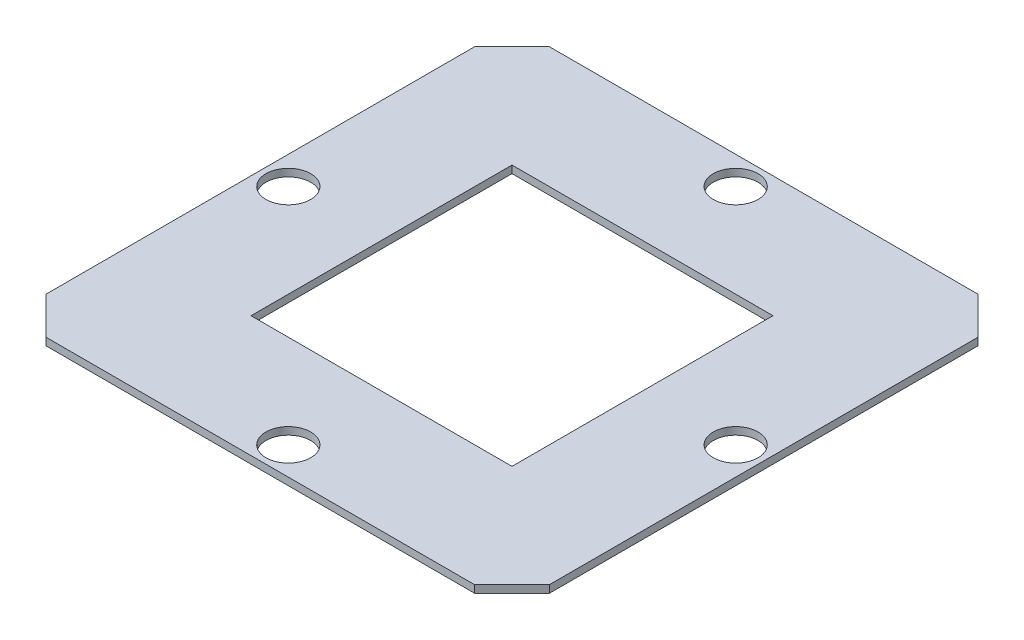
ISO-10303-21;
HEADER;
FILE_DESCRIPTION(('STEP AP214'),'2;1');
FILE_NAME('part.step','',(''),(''),'','','');
FILE_SCHEMA(('AUTOMOTIVE_DESIGN { 1 0 10303 214 1 1 1 1 }'));
ENDSEC;
DATA;
#1=APPLICATION_CONTEXT('core data for automotive mechanical design processes');
#2=APPLICATION_PROTOCOL_DEFINITION('international standard','automotive_design',2000,#1);
#3=PRODUCT_CONTEXT('',#1,'mechanical');
#4=PRODUCT('Part','Part','',(#3));
#5=PRODUCT_RELATED_PRODUCT_CATEGORY('part','',(#4));
#6=PRODUCT_DEFINITION_FORMATION('','',#4);
#7=PRODUCT_DEFINITION_CONTEXT('part definition',#1,'design');
#8=PRODUCT_DEFINITION('design','',#6,#7);
#9=PRODUCT_DEFINITION_SHAPE('','',#8);
#10=(LENGTH_UNIT() NAMED_UNIT(*) SI_UNIT(.MILLI.,.METRE.));
#11=(NAMED_UNIT(*) PLANE_ANGLE_UNIT() SI_UNIT($,.RADIAN.));
#12=(NAMED_UNIT(*) SI_UNIT($,.STERADIAN.) SOLID_ANGLE_UNIT());
#13=UNCERTAINTY_MEASURE_WITH_UNIT(LENGTH_MEASURE(1.E-05),#10,'distance_accuracy_value','');
#14=(GEOMETRIC_REPRESENTATION_CONTEXT(3) GLOBAL_UNCERTAINTY_ASSIGNED_CONTEXT((#13)) GLOBAL_UNIT_ASSIGNED_CONTEXT((#10,
#11,#12)) REPRESENTATION_CONTEXT('',''));
#15=CARTESIAN_POINT('',(0.,0.,0.));
#16=DIRECTION('',(0.,0.,1.));
#17=DIRECTION('',(1.,0.,0.));
#18=AXIS2_PLACEMENT_3D('',#15,#16,#17);
#19=CARTESIAN_POINT('',(-67.5,2.,-67.5));
#20=DIRECTION('',(0.,0.,1.));
#21=DIRECTION('',(1.,0.,0.));
#22=AXIS2_PLACEMENT_3D('',#19,#20,#21);
#23=PLANE('',#22);
#24=DIRECTION('',(-1.,0.,0.));
#25=VECTOR('',#24,1.);
#26=CARTESIAN_POINT('',(-67.5,0.,-67.5));
#27=LINE('',#26,#25);
#28=CARTESIAN_POINT('',(57.5,0.,-67.5));
#29=VERTEX_POINT('',#28);
#30=CARTESIAN_POINT('',(-57.5,0.,-67.5));
#31=VERTEX_POINT('',#30);
#32=EDGE_CURVE('E176',#29,#31,#27,.T.);
#33=ORIENTED_EDGE('',*,*,#32,.T.);
#34=DIRECTION('',(0.,1.,0.));
#35=VECTOR('',#34,1.);
#36=CARTESIAN_POINT('',(-57.5,2.,-67.5));
#37=LINE('',#36,#35);
#38=CARTESIAN_POINT('',(-57.5,2.,-67.5));
#39=VERTEX_POINT('',#38);
#40=EDGE_CURVE('E218',#31,#39,#37,.T.);
#41=ORIENTED_EDGE('',*,*,#40,.T.);
#42=DIRECTION('',(-1.,0.,0.));
#43=VECTOR('',#42,1.);
#44=CARTESIAN_POINT('',(-67.5,2.,-67.5));
#45=LINE('',#44,#43);
#46=CARTESIAN_POINT('',(57.5,2.,-67.5));
#47=VERTEX_POINT('',#46);
#48=EDGE_CURVE('E179',#47,#39,#45,.T.);
#49=ORIENTED_EDGE('',*,*,#48,.F.);
#50=DIRECTION('',(0.,-1.,0.));
#51=VECTOR('',#50,1.);
#52=CARTESIAN_POINT('',(57.5,2.,-67.5));
#53=LINE('',#52,#51);
#54=EDGE_CURVE('E215',#47,#29,#53,.T.);
#55=ORIENTED_EDGE('',*,*,#54,.T.);
#56=EDGE_LOOP('',(#33,#41,#49,#55));
#57=FACE_BOUND('',#56,.T.);
#58=ADVANCED_FACE('F32',(#57),#23,.F.);
#59=CARTESIAN_POINT('',(-67.5,2.,67.5));
#60=DIRECTION('',(1.,0.,0.));
#61=DIRECTION('',(0.,0.,-1.));
#62=AXIS2_PLACEMENT_3D('',#59,#60,#61);
#63=PLANE('',#62);
#64=DIRECTION('',(0.,0.,1.));
#65=VECTOR('',#64,1.);
#66=CARTESIAN_POINT('',(-67.5,2.,67.5));
#67=LINE('',#66,#65);
#68=CARTESIAN_POINT('',(-67.5,2.,-57.5));
#69=VERTEX_POINT('',#68);
#70=CARTESIAN_POINT('',(-67.5,2.,57.5));
#71=VERTEX_POINT('',#70);
#72=EDGE_CURVE('E182',#69,#71,#67,.T.);
#73=ORIENTED_EDGE('',*,*,#72,.F.);
#74=DIRECTION('',(0.,-1.,0.));
#75=VECTOR('',#74,1.);
#76=CARTESIAN_POINT('',(-67.5,2.,-57.5));
#77=LINE('',#76,#75);
#78=CARTESIAN_POINT('',(-67.5,0.,-57.5));
#79=VERTEX_POINT('',#78);
#80=EDGE_CURVE('E204',#69,#79,#77,.T.);
#81=ORIENTED_EDGE('',*,*,#80,.T.);
#82=DIRECTION('',(0.,0.,1.));
#83=VECTOR('',#82,1.);
#84=CARTESIAN_POINT('',(-67.5,0.,67.5));
#85=LINE('',#84,#83);
#86=CARTESIAN_POINT('',(-67.5,0.,57.5));
#87=VERTEX_POINT('',#86);
#88=EDGE_CURVE('E195',#79,#87,#85,.T.);
#89=ORIENTED_EDGE('',*,*,#88,.T.);
#90=DIRECTION('',(0.,1.,0.));
#91=VECTOR('',#90,1.);
#92=CARTESIAN_POINT('',(-67.5,2.,57.5));
#93=LINE('',#92,#91);
#94=EDGE_CURVE('E192',#87,#71,#93,.T.);
#95=ORIENTED_EDGE('',*,*,#94,.T.);
#96=EDGE_LOOP('',(#73,#81,#89,#95));
#97=FACE_BOUND('',#96,.T.);
#98=ADVANCED_FACE('F268',(#97),#63,.F.);
#99=CARTESIAN_POINT('',(-67.5,2.,67.5));
#100=DIRECTION('',(0.,0.,-1.));
#101=DIRECTION('',(-1.,0.,0.));
#102=AXIS2_PLACEMENT_3D('',#99,#100,#101);
#103=PLANE('',#102);
#104=DIRECTION('',(1.,0.,0.));
#105=VECTOR('',#104,1.);
#106=CARTESIAN_POINT('',(-67.5,0.,67.5));
#107=LINE('',#106,#105);
#108=CARTESIAN_POINT('',(-57.5,0.,67.5));
#109=VERTEX_POINT('',#108);
#110=CARTESIAN_POINT('',(57.5,0.,67.5));
#111=VERTEX_POINT('',#110);
#112=EDGE_CURVE('E198',#109,#111,#107,.T.);
#113=ORIENTED_EDGE('',*,*,#112,.T.);
#114=DIRECTION('',(0.,1.,0.));
#115=VECTOR('',#114,1.);
#116=CARTESIAN_POINT('',(57.5,2.,67.5));
#117=LINE('',#116,#115);
#118=CARTESIAN_POINT('',(57.4999999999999,2.,67.5));
#119=VERTEX_POINT('',#118);
#120=EDGE_CURVE('E11',#111,#119,#117,.T.);
#121=ORIENTED_EDGE('',*,*,#120,.T.);
#122=DIRECTION('',(1.,0.,0.));
#123=VECTOR('',#122,1.);
#124=CARTESIAN_POINT('',(-67.5,2.,67.5));
#125=LINE('',#124,#123);
#126=CARTESIAN_POINT('',(-57.5,2.,67.5));
#127=VERTEX_POINT('',#126);
#128=EDGE_CURVE('E186',#127,#119,#125,.T.);
#129=ORIENTED_EDGE('',*,*,#128,.F.);
#130=DIRECTION('',(0.,-1.,0.));
#131=VECTOR('',#130,1.);
#132=CARTESIAN_POINT('',(-57.5,2.,67.5));
#133=LINE('',#132,#131);
#134=EDGE_CURVE('E40',#127,#109,#133,.T.);
#135=ORIENTED_EDGE('',*,*,#134,.T.);
#136=EDGE_LOOP('',(#113,#121,#129,#135));
#137=FACE_BOUND('',#136,.T.);
#138=ADVANCED_FACE('F237',(#137),#103,.F.);
#139=CARTESIAN_POINT('',(67.5,2.,67.5));
#140=DIRECTION('',(-1.,0.,0.));
#141=DIRECTION('',(0.,0.,1.));
#142=AXIS2_PLACEMENT_3D('',#139,#140,#141);
#143=PLANE('',#142);
#144=DIRECTION('',(0.,0.,-1.));
#145=VECTOR('',#144,1.);
#146=CARTESIAN_POINT('',(67.5,0.,67.5));
#147=LINE('',#146,#145);
#148=CARTESIAN_POINT('',(67.5,0.,57.5));
#149=VERTEX_POINT('',#148);
#150=CARTESIAN_POINT('',(67.5,0.,-57.5));
#151=VERTEX_POINT('',#150);
#152=EDGE_CURVE('E183',#149,#151,#147,.T.);
#153=ORIENTED_EDGE('',*,*,#152,.T.);
#154=DIRECTION('',(0.,1.,0.));
#155=VECTOR('',#154,1.);
#156=CARTESIAN_POINT('',(67.5,2.,-57.5));
#157=LINE('',#156,#155);
#158=CARTESIAN_POINT('',(67.5,2.,-57.4999999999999));
#159=VERTEX_POINT('',#158);
#160=EDGE_CURVE('E231',#151,#159,#157,.T.);
#161=ORIENTED_EDGE('',*,*,#160,.T.);
#162=DIRECTION('',(0.,0.,-1.));
#163=VECTOR('',#162,1.);
#164=CARTESIAN_POINT('',(67.5,2.,67.5));
#165=LINE('',#164,#163);
#166=CARTESIAN_POINT('',(67.5,2.,57.5));
#167=VERTEX_POINT('',#166);
#168=EDGE_CURVE('E189',#167,#159,#165,.T.);
#169=ORIENTED_EDGE('',*,*,#168,.F.);
#170=DIRECTION('',(0.,-1.,0.));
#171=VECTOR('',#170,1.);
#172=CARTESIAN_POINT('',(67.5,2.,57.5));
#173=LINE('',#172,#171);
#174=EDGE_CURVE('E228',#167,#149,#173,.T.);
#175=ORIENTED_EDGE('',*,*,#174,.T.);
#176=EDGE_LOOP('',(#153,#161,#169,#175));
#177=FACE_BOUND('',#176,.T.);
#178=ADVANCED_FACE('F251',(#177),#143,.F.);
#179=CARTESIAN_POINT('',(67.5,2.,-67.5));
#180=DIRECTION('',(0.,1.,0.));
#181=DIRECTION('',(0.,0.,1.));
#182=AXIS2_PLACEMENT_3D('',#179,#180,#181);
#183=PLANE('',#182);
#184=DIRECTION('',(-1.,0.,0.));
#185=VECTOR('',#184,1.);
#186=CARTESIAN_POINT('',(-35.,2.,35.));
#187=LINE('',#186,#185);
#188=CARTESIAN_POINT('',(35.,2.,35.));
#189=VERTEX_POINT('',#188);
#190=CARTESIAN_POINT('',(-35.,2.,35.));
#191=VERTEX_POINT('',#190);
#192=EDGE_CURVE('E130',#189,#191,#187,.T.);
#193=ORIENTED_EDGE('',*,*,#192,.T.);
#194=DIRECTION('',(0.,0.,-1.));
#195=VECTOR('',#194,1.);
#196=CARTESIAN_POINT('',(-35.,2.,-35.));
#197=LINE('',#196,#195);
#198=CARTESIAN_POINT('',(-35.,2.,-35.));
#199=VERTEX_POINT('',#198);
#200=EDGE_CURVE('E119',#191,#199,#197,.T.);
#201=ORIENTED_EDGE('',*,*,#200,.T.);
#202=DIRECTION('',(1.,0.,0.));
#203=VECTOR('',#202,1.);
#204=CARTESIAN_POINT('',(-35.,2.,-35.));
#205=LINE('',#204,#203);
#206=CARTESIAN_POINT('',(35.,2.,-35.));
#207=VERTEX_POINT('',#206);
#208=EDGE_CURVE('E141',#199,#207,#205,.T.);
#209=ORIENTED_EDGE('',*,*,#208,.T.);
#210=DIRECTION('',(0.,0.,1.));
#211=VECTOR('',#210,1.);
#212=CARTESIAN_POINT('',(35.,2.,-35.));
#213=LINE('',#212,#211);
#214=EDGE_CURVE('E137',#207,#189,#213,.T.);
#215=ORIENTED_EDGE('',*,*,#214,.T.);
#216=EDGE_LOOP('',(#193,#201,#209,#215));
#217=FACE_BOUND('',#216,.T.);
#218=CARTESIAN_POINT('',(-59.9999999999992,2.,0.));
#219=DIRECTION('',(0.,1.,0.));
#220=DIRECTION('',(0.,0.,1.));
#221=AXIS2_PLACEMENT_3D('',#218,#219,#220);
#222=CIRCLE('',#221,6.);
#223=CARTESIAN_POINT('',(-59.9999999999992,2.,6.));
#224=VERTEX_POINT('',#223);
#225=EDGE_CURVE('E126',#224,#224,#222,.T.);
#226=ORIENTED_EDGE('',*,*,#225,.F.);
#227=EDGE_LOOP('',(#226));
#228=FACE_BOUND('',#227,.T.);
#229=CARTESIAN_POINT('',(7.84422772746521E-13,2.,60.));
#230=DIRECTION('',(0.,1.,0.));
#231=DIRECTION('',(0.,0.,1.));
#232=AXIS2_PLACEMENT_3D('',#229,#230,#231);
#233=CIRCLE('',#232,6.);
#234=CARTESIAN_POINT('',(7.84422772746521E-13,2.,66.));
#235=VERTEX_POINT('',#234);
#236=EDGE_CURVE('E158',#235,#235,#233,.T.);
#237=ORIENTED_EDGE('',*,*,#236,.F.);
#238=EDGE_LOOP('',(#237));
#239=FACE_BOUND('',#238,.T.);
#240=CARTESIAN_POINT('',(60.,2.,0.));
#241=DIRECTION('',(0.,1.,0.));
#242=DIRECTION('',(0.,0.,1.));
#243=AXIS2_PLACEMENT_3D('',#240,#241,#242);
#244=CIRCLE('',#243,6.);
#245=CARTESIAN_POINT('',(60.,2.,6.));
#246=VERTEX_POINT('',#245);
#247=EDGE_CURVE('E164',#246,#246,#244,.T.);
#248=ORIENTED_EDGE('',*,*,#247,.F.);
#249=EDGE_LOOP('',(#248));
#250=FACE_BOUND('',#249,.T.);
#251=CARTESIAN_POINT('',(7.69685902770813E-13,2.,-60.));
#252=DIRECTION('',(0.,1.,0.));
#253=DIRECTION('',(0.,0.,1.));
#254=AXIS2_PLACEMENT_3D('',#251,#252,#253);
#255=CIRCLE('',#254,6.);
#256=CARTESIAN_POINT('',(7.69685902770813E-13,2.,-54.));
#257=VERTEX_POINT('',#256);
#258=EDGE_CURVE('E170',#257,#257,#255,.T.);
#259=ORIENTED_EDGE('',*,*,#258,.F.);
#260=EDGE_LOOP('',(#259));
#261=FACE_BOUND('',#260,.T.);
#262=ORIENTED_EDGE('',*,*,#48,.T.);
#263=DIRECTION('',(0.707106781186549,0.,-0.707106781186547));
#264=VECTOR('',#263,1.);
#265=CARTESIAN_POINT('',(5.00000000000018,2.,-130.));
#266=LINE('',#265,#264);
#267=EDGE_CURVE('E226',#39,#69,#266,.F.);
#268=ORIENTED_EDGE('',*,*,#267,.T.);
#269=ORIENTED_EDGE('',*,*,#72,.T.);
#270=DIRECTION('',(-0.707106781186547,0.,-0.707106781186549));
#271=VECTOR('',#270,1.);
#272=CARTESIAN_POINT('',(-62.5000000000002,2.,62.4999999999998));
#273=LINE('',#272,#271);
#274=EDGE_CURVE('E220',#71,#127,#273,.F.);
#275=ORIENTED_EDGE('',*,*,#274,.T.);
#276=ORIENTED_EDGE('',*,*,#128,.T.);
#277=DIRECTION('',(-0.707106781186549,0.,0.707106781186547));
#278=VECTOR('',#277,1.);
#279=CARTESIAN_POINT('',(130.,2.,-4.99999999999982));
#280=LINE('',#279,#278);
#281=EDGE_CURVE('E222',#119,#167,#280,.F.);
#282=ORIENTED_EDGE('',*,*,#281,.T.);
#283=ORIENTED_EDGE('',*,*,#168,.T.);
#284=DIRECTION('',(0.707106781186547,0.,0.707106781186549));
#285=VECTOR('',#284,1.);
#286=CARTESIAN_POINT('',(62.5,2.,-62.5));
#287=LINE('',#286,#285);
#288=EDGE_CURVE('E224',#159,#47,#287,.F.);
#289=ORIENTED_EDGE('',*,*,#288,.T.);
#290=EDGE_LOOP('',(#262,#268,#269,#275,#276,#282,#283,#289));
#291=FACE_BOUND('',#290,.T.);
#292=ADVANCED_FACE('F135',(#217,#228,#239,#250,#261,#291),#183,.T.);
#293=CARTESIAN_POINT('',(67.5,0.,-67.5));
#294=DIRECTION('',(0.,1.,0.));
#295=DIRECTION('',(0.,0.,1.));
#296=AXIS2_PLACEMENT_3D('',#293,#294,#295);
#297=PLANE('',#296);
#298=DIRECTION('',(0.,0.,-1.));
#299=VECTOR('',#298,1.);
#300=CARTESIAN_POINT('',(-35.,0.,-35.));
#301=LINE('',#300,#299);
#302=CARTESIAN_POINT('',(-35.,0.,35.));
#303=VERTEX_POINT('',#302);
#304=CARTESIAN_POINT('',(-35.,0.,-35.));
#305=VERTEX_POINT('',#304);
#306=EDGE_CURVE('E139',#303,#305,#301,.T.);
#307=ORIENTED_EDGE('',*,*,#306,.F.);
#308=DIRECTION('',(-1.,0.,0.));
#309=VECTOR('',#308,1.);
#310=CARTESIAN_POINT('',(-35.,0.,35.));
#311=LINE('',#310,#309);
#312=CARTESIAN_POINT('',(35.,0.,35.));
#313=VERTEX_POINT('',#312);
#314=EDGE_CURVE('E55',#313,#303,#311,.T.);
#315=ORIENTED_EDGE('',*,*,#314,.F.);
#316=DIRECTION('',(0.,0.,1.));
#317=VECTOR('',#316,1.);
#318=CARTESIAN_POINT('',(35.,0.,-35.));
#319=LINE('',#318,#317);
#320=CARTESIAN_POINT('',(35.,0.,-35.));
#321=VERTEX_POINT('',#320);
#322=EDGE_CURVE('E132',#321,#313,#319,.T.);
#323=ORIENTED_EDGE('',*,*,#322,.F.);
#324=DIRECTION('',(1.,0.,0.));
#325=VECTOR('',#324,1.);
#326=CARTESIAN_POINT('',(-35.,0.,-35.));
#327=LINE('',#326,#325);
#328=EDGE_CURVE('E146',#305,#321,#327,.T.);
#329=ORIENTED_EDGE('',*,*,#328,.F.);
#330=EDGE_LOOP('',(#307,#315,#323,#329));
#331=FACE_BOUND('',#330,.T.);
#332=CARTESIAN_POINT('',(-59.9999999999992,0.,0.));
#333=DIRECTION('',(0.,1.,0.));
#334=DIRECTION('',(0.,0.,1.));
#335=AXIS2_PLACEMENT_3D('',#332,#333,#334);
#336=CIRCLE('',#335,6.);
#337=CARTESIAN_POINT('',(-59.9999999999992,0.,6.));
#338=VERTEX_POINT('',#337);
#339=EDGE_CURVE('E155',#338,#338,#336,.T.);
#340=ORIENTED_EDGE('',*,*,#339,.T.);
#341=EDGE_LOOP('',(#340));
#342=FACE_BOUND('',#341,.T.);
#343=CARTESIAN_POINT('',(7.84422772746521E-13,0.,60.));
#344=DIRECTION('',(0.,1.,0.));
#345=DIRECTION('',(0.,0.,1.));
#346=AXIS2_PLACEMENT_3D('',#343,#344,#345);
#347=CIRCLE('',#346,6.);
#348=CARTESIAN_POINT('',(7.84422772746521E-13,0.,66.));
#349=VERTEX_POINT('',#348);
#350=EDGE_CURVE('E161',#349,#349,#347,.T.);
#351=ORIENTED_EDGE('',*,*,#350,.T.);
#352=EDGE_LOOP('',(#351));
#353=FACE_BOUND('',#352,.T.);
#354=CARTESIAN_POINT('',(60.,0.,0.));
#355=DIRECTION('',(0.,1.,0.));
#356=DIRECTION('',(0.,0.,1.));
#357=AXIS2_PLACEMENT_3D('',#354,#355,#356);
#358=CIRCLE('',#357,6.);
#359=CARTESIAN_POINT('',(60.,0.,6.));
#360=VERTEX_POINT('',#359);
#361=EDGE_CURVE('E167',#360,#360,#358,.T.);
#362=ORIENTED_EDGE('',*,*,#361,.T.);
#363=EDGE_LOOP('',(#362));
#364=FACE_BOUND('',#363,.T.);
#365=CARTESIAN_POINT('',(7.69685902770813E-13,0.,-60.));
#366=DIRECTION('',(0.,1.,0.));
#367=DIRECTION('',(0.,0.,1.));
#368=AXIS2_PLACEMENT_3D('',#365,#366,#367);
#369=CIRCLE('',#368,6.);
#370=CARTESIAN_POINT('',(7.69685902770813E-13,0.,-54.));
#371=VERTEX_POINT('',#370);
#372=EDGE_CURVE('E173',#371,#371,#369,.T.);
#373=ORIENTED_EDGE('',*,*,#372,.T.);
#374=EDGE_LOOP('',(#373));
#375=FACE_BOUND('',#374,.T.);
#376=ORIENTED_EDGE('',*,*,#88,.F.);
#377=DIRECTION('',(-0.707106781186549,0.,0.707106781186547));
#378=VECTOR('',#377,1.);
#379=CARTESIAN_POINT('',(-67.5,0.,-57.5));
#380=LINE('',#379,#378);
#381=EDGE_CURVE('E213',#79,#31,#380,.F.);
#382=ORIENTED_EDGE('',*,*,#381,.T.);
#383=ORIENTED_EDGE('',*,*,#32,.F.);
#384=DIRECTION('',(-0.707106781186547,0.,-0.707106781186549));
#385=VECTOR('',#384,1.);
#386=CARTESIAN_POINT('',(57.5,0.,-67.5));
#387=LINE('',#386,#385);
#388=EDGE_CURVE('E211',#29,#151,#387,.F.);
#389=ORIENTED_EDGE('',*,*,#388,.T.);
#390=ORIENTED_EDGE('',*,*,#152,.F.);
#391=DIRECTION('',(0.707106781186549,0.,-0.707106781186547));
#392=VECTOR('',#391,1.);
#393=CARTESIAN_POINT('',(67.5,0.,57.5));
#394=LINE('',#393,#392);
#395=EDGE_CURVE('E209',#149,#111,#394,.F.);
#396=ORIENTED_EDGE('',*,*,#395,.T.);
#397=ORIENTED_EDGE('',*,*,#112,.F.);
#398=DIRECTION('',(0.707106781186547,0.,0.707106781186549));
#399=VECTOR('',#398,1.);
#400=CARTESIAN_POINT('',(-57.5,0.,67.5));
#401=LINE('',#400,#399);
#402=EDGE_CURVE('E207',#109,#87,#401,.F.);
#403=ORIENTED_EDGE('',*,*,#402,.T.);
#404=EDGE_LOOP('',(#376,#382,#383,#389,#390,#396,#397,#403));
#405=FACE_BOUND('',#404,.T.);
#406=ADVANCED_FACE('F243',(#331,#342,#353,#364,#375,#405),#297,.F.);
#407=CARTESIAN_POINT('',(7.69685902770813E-13,0.,-60.));
#408=DIRECTION('',(0.,1.,0.));
#409=DIRECTION('',(0.,0.,1.));
#410=AXIS2_PLACEMENT_3D('',#407,#408,#409);
#411=CYLINDRICAL_SURFACE('',#410,6.);
#412=ORIENTED_EDGE('',*,*,#372,.F.);
#413=EDGE_LOOP('',(#412));
#414=FACE_BOUND('',#413,.T.);
#415=ORIENTED_EDGE('',*,*,#258,.T.);
#416=EDGE_LOOP('',(#415));
#417=FACE_BOUND('',#416,.T.);
#418=ADVANCED_FACE('F322',(#414,#417),#411,.F.);
#419=CARTESIAN_POINT('',(60.,0.,0.));
#420=DIRECTION('',(0.,1.,0.));
#421=DIRECTION('',(0.,0.,1.));
#422=AXIS2_PLACEMENT_3D('',#419,#420,#421);
#423=CYLINDRICAL_SURFACE('',#422,6.);
#424=ORIENTED_EDGE('',*,*,#361,.F.);
#425=EDGE_LOOP('',(#424));
#426=FACE_BOUND('',#425,.T.);
#427=ORIENTED_EDGE('',*,*,#247,.T.);
#428=EDGE_LOOP('',(#427));
#429=FACE_BOUND('',#428,.T.);
#430=ADVANCED_FACE('F367',(#426,#429),#423,.F.);
#431=CARTESIAN_POINT('',(7.84422772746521E-13,0.,60.));
#432=DIRECTION('',(0.,1.,0.));
#433=DIRECTION('',(0.,0.,1.));
#434=AXIS2_PLACEMENT_3D('',#431,#432,#433);
#435=CYLINDRICAL_SURFACE('',#434,6.);
#436=ORIENTED_EDGE('',*,*,#350,.F.);
#437=EDGE_LOOP('',(#436));
#438=FACE_BOUND('',#437,.T.);
#439=ORIENTED_EDGE('',*,*,#236,.T.);
#440=EDGE_LOOP('',(#439));
#441=FACE_BOUND('',#440,.T.);
#442=ADVANCED_FACE('F363',(#438,#441),#435,.F.);
#443=CARTESIAN_POINT('',(-59.9999999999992,0.,0.));
#444=DIRECTION('',(0.,1.,0.));
#445=DIRECTION('',(0.,0.,1.));
#446=AXIS2_PLACEMENT_3D('',#443,#444,#445);
#447=CYLINDRICAL_SURFACE('',#446,6.);
#448=ORIENTED_EDGE('',*,*,#339,.F.);
#449=EDGE_LOOP('',(#448));
#450=FACE_BOUND('',#449,.T.);
#451=ORIENTED_EDGE('',*,*,#225,.T.);
#452=EDGE_LOOP('',(#451));
#453=FACE_BOUND('',#452,.T.);
#454=ADVANCED_FACE('F287',(#450,#453),#447,.F.);
#455=CARTESIAN_POINT('',(-67.5,2.,-57.5));
#456=DIRECTION('',(0.707106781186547,0.,0.707106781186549));
#457=DIRECTION('',(0.707106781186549,0.,-0.707106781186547));
#458=AXIS2_PLACEMENT_3D('',#455,#456,#457);
#459=PLANE('',#458);
#460=ORIENTED_EDGE('',*,*,#267,.F.);
#461=ORIENTED_EDGE('',*,*,#40,.F.);
#462=ORIENTED_EDGE('',*,*,#381,.F.);
#463=ORIENTED_EDGE('',*,*,#80,.F.);
#464=EDGE_LOOP('',(#460,#461,#462,#463));
#465=FACE_BOUND('',#464,.T.);
#466=ADVANCED_FACE('F265',(#465),#459,.F.);
#467=CARTESIAN_POINT('',(57.5,2.,-67.5));
#468=DIRECTION('',(-0.707106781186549,0.,0.707106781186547));
#469=DIRECTION('',(0.707106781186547,0.,0.707106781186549));
#470=AXIS2_PLACEMENT_3D('',#467,#468,#469);
#471=PLANE('',#470);
#472=ORIENTED_EDGE('',*,*,#288,.F.);
#473=ORIENTED_EDGE('',*,*,#160,.F.);
#474=ORIENTED_EDGE('',*,*,#388,.F.);
#475=ORIENTED_EDGE('',*,*,#54,.F.);
#476=EDGE_LOOP('',(#472,#473,#474,#475));
#477=FACE_BOUND('',#476,.T.);
#478=ADVANCED_FACE('F258',(#477),#471,.F.);
#479=CARTESIAN_POINT('',(67.5,2.,57.5));
#480=DIRECTION('',(-0.707106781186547,0.,-0.707106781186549));
#481=DIRECTION('',(-0.707106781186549,0.,0.707106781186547));
#482=AXIS2_PLACEMENT_3D('',#479,#480,#481);
#483=PLANE('',#482);
#484=ORIENTED_EDGE('',*,*,#281,.F.);
#485=ORIENTED_EDGE('',*,*,#120,.F.);
#486=ORIENTED_EDGE('',*,*,#395,.F.);
#487=ORIENTED_EDGE('',*,*,#174,.F.);
#488=EDGE_LOOP('',(#484,#485,#486,#487));
#489=FACE_BOUND('',#488,.T.);
#490=ADVANCED_FACE('F248',(#489),#483,.F.);
#491=CARTESIAN_POINT('',(-57.5,2.,67.5));
#492=DIRECTION('',(0.707106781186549,0.,-0.707106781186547));
#493=DIRECTION('',(-0.707106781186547,0.,-0.707106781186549));
#494=AXIS2_PLACEMENT_3D('',#491,#492,#493);
#495=PLANE('',#494);
#496=ORIENTED_EDGE('',*,*,#274,.F.);
#497=ORIENTED_EDGE('',*,*,#94,.F.);
#498=ORIENTED_EDGE('',*,*,#402,.F.);
#499=ORIENTED_EDGE('',*,*,#134,.F.);
#500=EDGE_LOOP('',(#496,#497,#498,#499));
#501=FACE_BOUND('',#500,.T.);
#502=ADVANCED_FACE('F34',(#501),#495,.F.);
#503=CARTESIAN_POINT('',(-35.,2.001,35.));
#504=DIRECTION('',(0.,0.,1.));
#505=DIRECTION('',(1.,0.,0.));
#506=AXIS2_PLACEMENT_3D('',#503,#504,#505);
#507=PLANE('',#506);
#508=DIRECTION('',(0.,-1.,0.));
#509=VECTOR('',#508,1.);
#510=CARTESIAN_POINT('',(35.,2.001,35.));
#511=LINE('',#510,#509);
#512=EDGE_CURVE('E127',#189,#313,#511,.T.);
#513=ORIENTED_EDGE('',*,*,#512,.T.);
#514=ORIENTED_EDGE('',*,*,#314,.T.);
#515=DIRECTION('',(0.,-1.,0.));
#516=VECTOR('',#515,1.);
#517=CARTESIAN_POINT('',(-35.,2.001,35.));
#518=LINE('',#517,#516);
#519=EDGE_CURVE('E121',#191,#303,#518,.T.);
#520=ORIENTED_EDGE('',*,*,#519,.F.);
#521=ORIENTED_EDGE('',*,*,#192,.F.);
#522=EDGE_LOOP('',(#513,#514,#520,#521));
#523=FACE_BOUND('',#522,.T.);
#524=ADVANCED_FACE('F129',(#523),#507,.F.);
#525=CARTESIAN_POINT('',(35.,2.001,-35.));
#526=DIRECTION('',(1.,0.,0.));
#527=DIRECTION('',(0.,0.,-1.));
#528=AXIS2_PLACEMENT_3D('',#525,#526,#527);
#529=PLANE('',#528);
#530=DIRECTION('',(0.,-1.,0.));
#531=VECTOR('',#530,1.);
#532=CARTESIAN_POINT('',(35.,2.001,-35.));
#533=LINE('',#532,#531);
#534=EDGE_CURVE('E152',#207,#321,#533,.T.);
#535=ORIENTED_EDGE('',*,*,#534,.T.);
#536=ORIENTED_EDGE('',*,*,#322,.T.);
#537=ORIENTED_EDGE('',*,*,#512,.F.);
#538=ORIENTED_EDGE('',*,*,#214,.F.);
#539=EDGE_LOOP('',(#535,#536,#537,#538));
#540=FACE_BOUND('',#539,.T.);
#541=ADVANCED_FACE('F275',(#540),#529,.F.);
#542=CARTESIAN_POINT('',(-35.,2.001,-35.));
#543=DIRECTION('',(0.,0.,-1.));
#544=DIRECTION('',(-1.,0.,0.));
#545=AXIS2_PLACEMENT_3D('',#542,#543,#544);
#546=PLANE('',#545);
#547=DIRECTION('',(0.,-1.,0.));
#548=VECTOR('',#547,1.);
#549=CARTESIAN_POINT('',(-35.,2.001,-35.));
#550=LINE('',#549,#548);
#551=EDGE_CURVE('E47',#199,#305,#550,.T.);
#552=ORIENTED_EDGE('',*,*,#551,.T.);
#553=ORIENTED_EDGE('',*,*,#328,.T.);
#554=ORIENTED_EDGE('',*,*,#534,.F.);
#555=ORIENTED_EDGE('',*,*,#208,.F.);
#556=EDGE_LOOP('',(#552,#553,#554,#555));
#557=FACE_BOUND('',#556,.T.);
#558=ADVANCED_FACE('F339',(#557),#546,.F.);
#559=CARTESIAN_POINT('',(-35.,2.001,-35.));
#560=DIRECTION('',(-1.,0.,0.));
#561=DIRECTION('',(0.,0.,1.));
#562=AXIS2_PLACEMENT_3D('',#559,#560,#561);
#563=PLANE('',#562);
#564=ORIENTED_EDGE('',*,*,#519,.T.);
#565=ORIENTED_EDGE('',*,*,#306,.T.);
#566=ORIENTED_EDGE('',*,*,#551,.F.);
#567=ORIENTED_EDGE('',*,*,#200,.F.);
#568=EDGE_LOOP('',(#564,#565,#566,#567));
#569=FACE_BOUND('',#568,.T.);
#570=ADVANCED_FACE('F120',(#569),#563,.F.);
#571=CLOSED_SHELL('',(#58,#98,#138,#178,#292,#406,#418,#430,#442,#454,#466,#478,#490,#502,#524,
#541,#558,#570));
#572=MANIFOLD_SOLID_BREP('B2',#571);
#573=ADVANCED_BREP_SHAPE_REPRESENTATION('',(#18,#572),#14);
#574=SHAPE_DEFINITION_REPRESENTATION(#9,#573);
ENDSEC;
END-ISO-10303-21;
